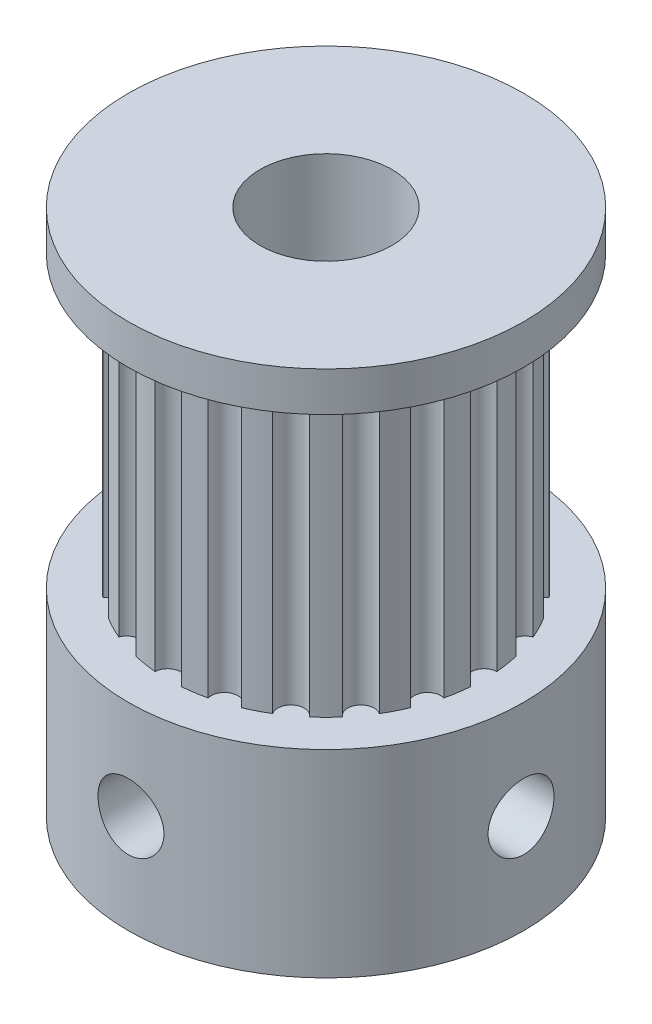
from build123d import *

# Parameters (mm, degrees)
SCHNITT_LINEAR_AUSTRAGEN1_DEPTH = 11
KREISMUSTER1_COUNT              = 20
SKIZZE4_W                       = 1.25
SKIZZE4_H                       = 7.5
SKIZZE6_W                       = 1.25
SKIZZE6_H                       = 7.5


with BuildPart() as part:
    # Skizze1 → Rotation1 (revolve)
    with BuildSketch(Plane.XY):
        Polygon((2.5, -10), (2.5, 10), (7.5, 10), (7.5, 8.5), (6, 8.5), (6, -2.5), (7.5, -2.5), (7.5, -10), align=None)
    revolve(axis=Axis((0, -10, 0), (0, 1, 0)))

    # Skizze2 → Schnitt-Linear austragen1 (cut)
    with BuildSketch(Plane(origin=(0, -2.5, 0), x_dir=(1, 0, 0), z_dir=(0, 1, 0))):
        with BuildLine():
            ThreePointArc((-0.499565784, 5.979166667), (0, 5.5), (0.499565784, 5.979166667))
            ThreePointArc((0.499565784, 5.979166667), (0, 6), (-0.499565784, 5.979166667))
        make_face()
    schnitt_linear_austragen1 = extrude(amount=SCHNITT_LINEAR_AUSTRAGEN1_DEPTH, mode=Mode.SUBTRACT)

    # Kreismuster1: Schnitt-Linear austragen1 ×20 about axis
    kreismuster1_axis = Axis((0, 0, 0), (0, 1, 0))
    for i in range(1, KREISMUSTER1_COUNT):
        add(schnitt_linear_austragen1.rotate(kreismuster1_axis, i * 360 / KREISMUSTER1_COUNT), mode=Mode.SUBTRACT)

    # Skizze4 → M3 Gewindebohrung1 (revolve, cut)
    with BuildSketch(Plane(origin=(0, -6.25, 0), x_dir=(0, 1, 0), z_dir=(1, 0, 0))):
        with Locations((0.625, 3.75)):
            Rectangle(SKIZZE4_W, SKIZZE4_H)
    revolve(axis=Axis((0, -6.25, -6.35), (0, 0, 1)), mode=Mode.SUBTRACT)

    # Skizze6 → M3 Gewindebohrung2 (revolve, cut)
    with BuildSketch(Plane.ZX.offset(-6.25)):
        with Locations((0.625, 3.75)):
            Rectangle(SKIZZE6_W, SKIZZE6_H)
    revolve(axis=Axis((-6.35, -6.25, 0), (1, 0, 0)), mode=Mode.SUBTRACT)


solid = part.part
